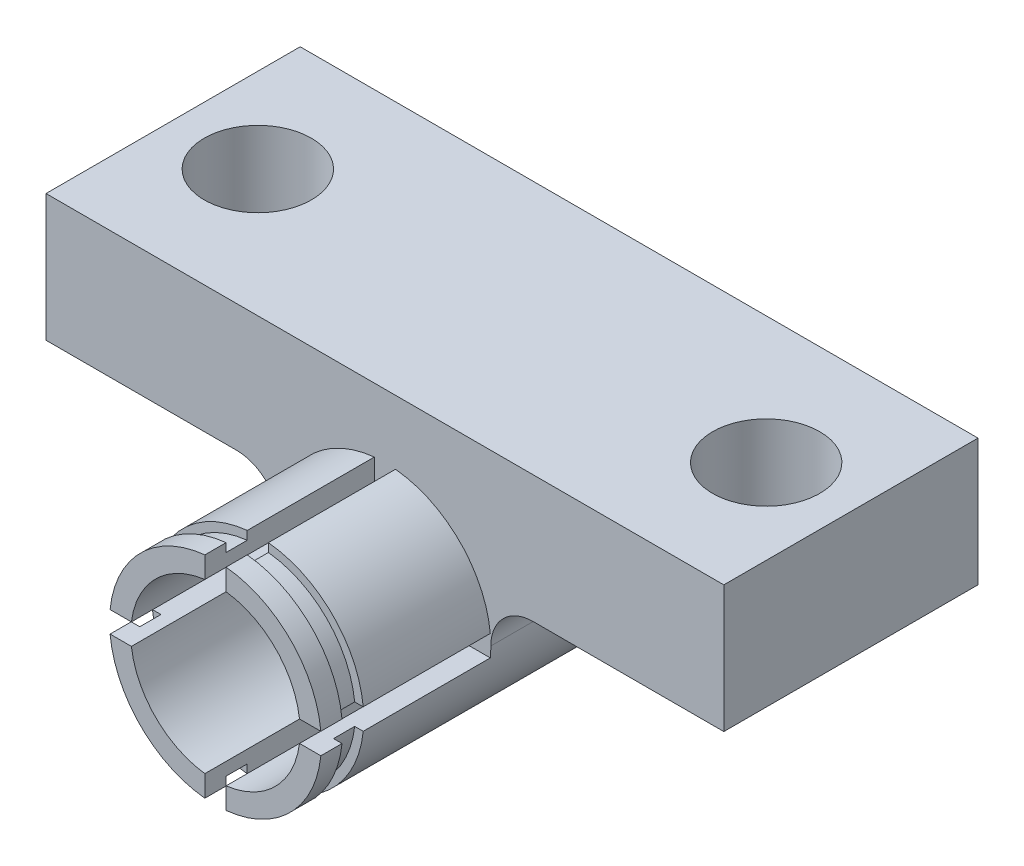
ISO-10303-21;
HEADER;
FILE_DESCRIPTION(('STEP AP214'),'2;1');
FILE_NAME('part.step','',(''),(''),'','','');
FILE_SCHEMA(('AUTOMOTIVE_DESIGN { 1 0 10303 214 1 1 1 1 }'));
ENDSEC;
DATA;
#1=APPLICATION_CONTEXT('core data for automotive mechanical design processes');
#2=APPLICATION_PROTOCOL_DEFINITION('international standard','automotive_design',2000,#1);
#3=PRODUCT_CONTEXT('',#1,'mechanical');
#4=PRODUCT('Part','Part','',(#3));
#5=PRODUCT_RELATED_PRODUCT_CATEGORY('part','',(#4));
#6=PRODUCT_DEFINITION_FORMATION('','',#4);
#7=PRODUCT_DEFINITION_CONTEXT('part definition',#1,'design');
#8=PRODUCT_DEFINITION('design','',#6,#7);
#9=PRODUCT_DEFINITION_SHAPE('','',#8);
#10=(LENGTH_UNIT() NAMED_UNIT(*) SI_UNIT(.MILLI.,.METRE.));
#11=(NAMED_UNIT(*) PLANE_ANGLE_UNIT() SI_UNIT($,.RADIAN.));
#12=(NAMED_UNIT(*) SI_UNIT($,.STERADIAN.) SOLID_ANGLE_UNIT());
#13=UNCERTAINTY_MEASURE_WITH_UNIT(LENGTH_MEASURE(1.E-05),#10,'distance_accuracy_value','');
#14=(GEOMETRIC_REPRESENTATION_CONTEXT(3) GLOBAL_UNCERTAINTY_ASSIGNED_CONTEXT((#13)) GLOBAL_UNIT_ASSIGNED_CONTEXT((#10,
#11,#12)) REPRESENTATION_CONTEXT('',''));
#15=CARTESIAN_POINT('',(0.,0.,0.));
#16=DIRECTION('',(0.,0.,1.));
#17=DIRECTION('',(1.,0.,0.));
#18=AXIS2_PLACEMENT_3D('',#15,#16,#17);
#19=CARTESIAN_POINT('',(25.4,12.7,-31.75));
#20=DIRECTION('',(0.,0.,1.));
#21=DIRECTION('',(1.,0.,0.));
#22=AXIS2_PLACEMENT_3D('',#19,#20,#21);
#23=CYLINDRICAL_SURFACE('',#22,7.93750000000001);
#24=DIRECTION('',(0.,0.,1.));
#25=VECTOR('',#24,1.);
#26=CARTESIAN_POINT('',(17.5022872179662,13.49375,-31.75));
#27=LINE('',#26,#25);
#28=CARTESIAN_POINT('',(17.5022872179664,13.49375,-3.17499999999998));
#29=VERTEX_POINT('',#28);
#30=CARTESIAN_POINT('',(17.5022872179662,13.49375,-12.7));
#31=VERTEX_POINT('',#30);
#32=EDGE_CURVE('E367',#29,#31,#27,.F.);
#33=ORIENTED_EDGE('',*,*,#32,.F.);
#34=CARTESIAN_POINT('',(25.4000000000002,12.7,-3.17499999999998));
#35=DIRECTION('',(0.,0.,1.));
#36=DIRECTION('',(1.,0.,0.));
#37=AXIS2_PLACEMENT_3D('',#34,#35,#36);
#38=CIRCLE('',#37,7.93750000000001);
#39=CARTESIAN_POINT('',(24.6062500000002,20.5977127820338,-3.17499999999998));
#40=VERTEX_POINT('',#39);
#41=EDGE_CURVE('E583',#40,#29,#38,.T.);
#42=ORIENTED_EDGE('',*,*,#41,.F.);
#43=DIRECTION('',(0.,0.,1.));
#44=VECTOR('',#43,1.);
#45=CARTESIAN_POINT('',(24.60625,20.5977127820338,-31.7499999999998));
#46=LINE('',#45,#44);
#47=CARTESIAN_POINT('',(24.60625,20.5977127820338,-12.7));
#48=VERTEX_POINT('',#47);
#49=EDGE_CURVE('E395',#48,#40,#46,.T.);
#50=ORIENTED_EDGE('',*,*,#49,.F.);
#51=CARTESIAN_POINT('',(25.4,12.7,-12.7));
#52=DIRECTION('',(0.,0.,1.));
#53=DIRECTION('',(1.,0.,0.));
#54=AXIS2_PLACEMENT_3D('',#51,#52,#53);
#55=CIRCLE('',#54,7.93750000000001);
#56=EDGE_CURVE('E414',#48,#31,#55,.T.);
#57=ORIENTED_EDGE('',*,*,#56,.T.);
#58=EDGE_LOOP('',(#33,#42,#50,#57));
#59=FACE_BOUND('',#58,.T.);
#60=ADVANCED_FACE('F40',(#59),#23,.T.);
#61=DIRECTION('',(0.,0.,1.));
#62=VECTOR('',#61,1.);
#63=CARTESIAN_POINT('',(26.19375,20.5977127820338,-31.75));
#64=LINE('',#63,#62);
#65=CARTESIAN_POINT('',(26.1937500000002,20.5977127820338,-3.17499999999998));
#66=VERTEX_POINT('',#65);
#67=CARTESIAN_POINT('',(26.19375,20.5977127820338,-12.7));
#68=VERTEX_POINT('',#67);
#69=EDGE_CURVE('E390',#66,#68,#64,.F.);
#70=ORIENTED_EDGE('',*,*,#69,.F.);
#71=CARTESIAN_POINT('',(33.2977127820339,13.49375,-3.17499999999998));
#72=VERTEX_POINT('',#71);
#73=EDGE_CURVE('E543',#72,#66,#38,.T.);
#74=ORIENTED_EDGE('',*,*,#73,.F.);
#75=DIRECTION('',(0.,0.,1.));
#76=VECTOR('',#75,1.);
#77=CARTESIAN_POINT('',(33.2977127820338,13.49375,-31.75));
#78=LINE('',#77,#76);
#79=CARTESIAN_POINT('',(33.2977127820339,13.49375,-12.7));
#80=VERTEX_POINT('',#79);
#81=EDGE_CURVE('E319',#80,#72,#78,.T.);
#82=ORIENTED_EDGE('',*,*,#81,.F.);
#83=EDGE_CURVE('E421',#80,#68,#55,.T.);
#84=ORIENTED_EDGE('',*,*,#83,.T.);
#85=EDGE_LOOP('',(#70,#74,#82,#84));
#86=FACE_BOUND('',#85,.T.);
#87=ADVANCED_FACE('F704',(#86),#23,.T.);
#88=DIRECTION('',(0.,0.,1.));
#89=VECTOR('',#88,1.);
#90=CARTESIAN_POINT('',(33.2977127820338,11.90625,-31.75));
#91=LINE('',#90,#89);
#92=CARTESIAN_POINT('',(33.2977127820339,11.90625,-3.17499999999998));
#93=VERTEX_POINT('',#92);
#94=CARTESIAN_POINT('',(33.2977127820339,11.90625,-12.7));
#95=VERTEX_POINT('',#94);
#96=EDGE_CURVE('E384',#93,#95,#91,.F.);
#97=ORIENTED_EDGE('',*,*,#96,.F.);
#98=CARTESIAN_POINT('',(26.1937500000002,4.8022872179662,-3.17499999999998));
#99=VERTEX_POINT('',#98);
#100=EDGE_CURVE('E542',#99,#93,#38,.T.);
#101=ORIENTED_EDGE('',*,*,#100,.F.);
#102=DIRECTION('',(0.,0.,1.));
#103=VECTOR('',#102,1.);
#104=CARTESIAN_POINT('',(26.19375,4.8022872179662,-31.75));
#105=LINE('',#104,#103);
#106=CARTESIAN_POINT('',(26.19375,4.8022872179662,-12.7));
#107=VERTEX_POINT('',#106);
#108=EDGE_CURVE('E381',#107,#99,#105,.T.);
#109=ORIENTED_EDGE('',*,*,#108,.F.);
#110=CARTESIAN_POINT('',(25.4,12.7,-12.7));
#111=DIRECTION('',(0.,0.,1.));
#112=DIRECTION('',(1.,0.,0.));
#113=AXIS2_PLACEMENT_3D('',#110,#111,#112);
#114=CIRCLE('',#113,7.93750000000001);
#115=CARTESIAN_POINT('',(24.60625,4.8022872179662,-12.7));
#116=VERTEX_POINT('',#115);
#117=EDGE_CURVE('E364',#107,#116,#114,.F.);
#118=ORIENTED_EDGE('',*,*,#117,.T.);
#119=DIRECTION('',(0.,0.,1.));
#120=VECTOR('',#119,1.);
#121=CARTESIAN_POINT('',(24.60625,4.8022872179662,-31.7499999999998));
#122=LINE('',#121,#120);
#123=CARTESIAN_POINT('',(24.6062500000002,4.8022872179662,-3.17499999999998));
#124=VERTEX_POINT('',#123);
#125=EDGE_CURVE('E376',#124,#116,#122,.F.);
#126=ORIENTED_EDGE('',*,*,#125,.F.);
#127=CARTESIAN_POINT('',(17.5022872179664,11.90625,-3.17499999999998));
#128=VERTEX_POINT('',#127);
#129=EDGE_CURVE('E591',#128,#124,#38,.T.);
#130=ORIENTED_EDGE('',*,*,#129,.F.);
#131=DIRECTION('',(0.,0.,1.));
#132=VECTOR('',#131,1.);
#133=CARTESIAN_POINT('',(17.5022872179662,11.90625,-31.75));
#134=LINE('',#133,#132);
#135=CARTESIAN_POINT('',(17.5022872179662,11.90625,-12.7));
#136=VERTEX_POINT('',#135);
#137=EDGE_CURVE('E373',#136,#128,#134,.T.);
#138=ORIENTED_EDGE('',*,*,#137,.F.);
#139=CARTESIAN_POINT('',(17.4625,12.7,-12.7));
#140=VERTEX_POINT('',#139);
#141=EDGE_CURVE('E368',#136,#140,#114,.F.);
#142=ORIENTED_EDGE('',*,*,#141,.T.);
#143=DIRECTION('',(0.,0.,1.));
#144=VECTOR('',#143,1.);
#145=CARTESIAN_POINT('',(17.4625,12.7,-31.75));
#146=LINE('',#145,#144);
#147=CARTESIAN_POINT('',(17.4625,12.7,-31.75));
#148=VERTEX_POINT('',#147);
#149=EDGE_CURVE('E450',#148,#140,#146,.T.);
#150=ORIENTED_EDGE('',*,*,#149,.F.);
#151=CARTESIAN_POINT('',(25.4,12.7,-31.75));
#152=DIRECTION('',(0.,0.,1.));
#153=DIRECTION('',(1.,0.,0.));
#154=AXIS2_PLACEMENT_3D('',#151,#152,#153);
#155=CIRCLE('',#154,7.93750000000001);
#156=CARTESIAN_POINT('',(33.3375,12.7,-31.75));
#157=VERTEX_POINT('',#156);
#158=EDGE_CURVE('E437',#148,#157,#155,.T.);
#159=ORIENTED_EDGE('',*,*,#158,.T.);
#160=DIRECTION('',(0.,0.,1.));
#161=VECTOR('',#160,1.);
#162=CARTESIAN_POINT('',(33.3375,12.7,-31.75));
#163=LINE('',#162,#161);
#164=CARTESIAN_POINT('',(33.3375000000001,12.7,-12.7));
#165=VERTEX_POINT('',#164);
#166=EDGE_CURVE('E446',#157,#165,#163,.T.);
#167=ORIENTED_EDGE('',*,*,#166,.T.);
#168=EDGE_CURVE('E349',#165,#95,#114,.F.);
#169=ORIENTED_EDGE('',*,*,#168,.T.);
#170=EDGE_LOOP('',(#97,#101,#109,#118,#126,#130,#138,#142,#150,#159,#167,#169));
#171=FACE_BOUND('',#170,.T.);
#172=ADVANCED_FACE('F655',(#171),#23,.T.);
#173=CARTESIAN_POINT('',(25.4,12.7,-1.58749999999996));
#174=DIRECTION('',(0.,0.,1.));
#175=DIRECTION('',(1.,0.,0.));
#176=AXIS2_PLACEMENT_3D('',#173,#174,#175);
#177=CIRCLE('',#176,7.93750000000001);
#178=CARTESIAN_POINT('',(26.19375,4.8022872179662,-1.58749999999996));
#179=VERTEX_POINT('',#178);
#180=CARTESIAN_POINT('',(33.2977127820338,11.90625,-1.58750000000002));
#181=VERTEX_POINT('',#180);
#182=EDGE_CURVE('E313',#179,#181,#177,.T.);
#183=ORIENTED_EDGE('',*,*,#182,.T.);
#184=CARTESIAN_POINT('',(33.2977127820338,11.90625,0.));
#185=VERTEX_POINT('',#184);
#186=EDGE_CURVE('E385',#185,#181,#91,.F.);
#187=ORIENTED_EDGE('',*,*,#186,.F.);
#188=CARTESIAN_POINT('',(25.4,12.7,0.));
#189=DIRECTION('',(0.,0.,1.));
#190=DIRECTION('',(1.,0.,0.));
#191=AXIS2_PLACEMENT_3D('',#188,#189,#190);
#192=CIRCLE('',#191,7.93750000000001);
#193=CARTESIAN_POINT('',(26.19375,4.8022872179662,0.));
#194=VERTEX_POINT('',#193);
#195=EDGE_CURVE('E436',#194,#185,#192,.T.);
#196=ORIENTED_EDGE('',*,*,#195,.F.);
#197=EDGE_CURVE('E380',#179,#194,#105,.T.);
#198=ORIENTED_EDGE('',*,*,#197,.F.);
#199=EDGE_LOOP('',(#183,#187,#196,#198));
#200=FACE_BOUND('',#199,.T.);
#201=ADVANCED_FACE('F629',(#200),#23,.T.);
#202=CARTESIAN_POINT('',(26.19375,11.90625,-12.7));
#203=DIRECTION('',(0.,-1.,0.));
#204=DIRECTION('',(0.,0.,-1.));
#205=AXIS2_PLACEMENT_3D('',#202,#203,#204);
#206=PLANE('',#205);
#207=DIRECTION('',(-1.,0.,0.));
#208=VECTOR('',#207,1.);
#209=CARTESIAN_POINT('',(26.1937500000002,11.90625,-3.17499999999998));
#210=LINE('',#209,#208);
#211=CARTESIAN_POINT('',(32.6592332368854,11.90625,-3.17499999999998));
#212=VERTEX_POINT('',#211);
#213=EDGE_CURVE('E320',#93,#212,#210,.T.);
#214=ORIENTED_EDGE('',*,*,#213,.F.);
#215=ORIENTED_EDGE('',*,*,#96,.T.);
#216=DIRECTION('',(1.,0.,0.));
#217=VECTOR('',#216,1.);
#218=CARTESIAN_POINT('',(26.19375,11.90625,-12.7));
#219=LINE('',#218,#217);
#220=CARTESIAN_POINT('',(31.7001953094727,11.90625,-12.7));
#221=VERTEX_POINT('',#220);
#222=EDGE_CURVE('E341',#221,#95,#219,.T.);
#223=ORIENTED_EDGE('',*,*,#222,.F.);
#224=DIRECTION('',(0.,0.,1.));
#225=VECTOR('',#224,1.);
#226=CARTESIAN_POINT('',(31.7001953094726,11.90625,-31.75));
#227=LINE('',#226,#225);
#228=CARTESIAN_POINT('',(31.7001953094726,11.90625,0.));
#229=VERTEX_POINT('',#228);
#230=EDGE_CURVE('E487',#229,#221,#227,.F.);
#231=ORIENTED_EDGE('',*,*,#230,.F.);
#232=DIRECTION('',(1.,0.,0.));
#233=VECTOR('',#232,1.);
#234=CARTESIAN_POINT('',(26.19375,11.90625,0.));
#235=LINE('',#234,#233);
#236=EDGE_CURVE('E359',#229,#185,#235,.T.);
#237=ORIENTED_EDGE('',*,*,#236,.T.);
#238=ORIENTED_EDGE('',*,*,#186,.T.);
#239=DIRECTION('',(-1.,0.,0.));
#240=VECTOR('',#239,1.);
#241=CARTESIAN_POINT('',(26.19375,11.90625,-1.58749999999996));
#242=LINE('',#241,#240);
#243=CARTESIAN_POINT('',(32.6592332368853,11.90625,-1.58750000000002));
#244=VERTEX_POINT('',#243);
#245=EDGE_CURVE('E571',#181,#244,#242,.T.);
#246=ORIENTED_EDGE('',*,*,#245,.T.);
#247=DIRECTION('',(0.,0.,1.));
#248=VECTOR('',#247,1.);
#249=CARTESIAN_POINT('',(32.6592332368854,11.90625,-3.17499999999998));
#250=LINE('',#249,#248);
#251=EDGE_CURVE('E303',#212,#244,#250,.T.);
#252=ORIENTED_EDGE('',*,*,#251,.F.);
#253=EDGE_LOOP('',(#214,#215,#223,#231,#237,#238,#246,#252));
#254=FACE_BOUND('',#253,.T.);
#255=ADVANCED_FACE('F626',(#254),#206,.F.);
#256=CARTESIAN_POINT('',(26.19375,13.49375,-12.7));
#257=DIRECTION('',(0.,1.,0.));
#258=DIRECTION('',(-1.,0.,0.));
#259=AXIS2_PLACEMENT_3D('',#256,#257,#258);
#260=PLANE('',#259);
#261=DIRECTION('',(1.,0.,0.));
#262=VECTOR('',#261,1.);
#263=CARTESIAN_POINT('',(26.1937500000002,13.49375,-3.17499999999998));
#264=LINE('',#263,#262);
#265=CARTESIAN_POINT('',(32.6592332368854,13.49375,-3.17499999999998));
#266=VERTEX_POINT('',#265);
#267=EDGE_CURVE('E308',#266,#72,#264,.T.);
#268=ORIENTED_EDGE('',*,*,#267,.F.);
#269=DIRECTION('',(0.,0.,1.));
#270=VECTOR('',#269,1.);
#271=CARTESIAN_POINT('',(32.6592332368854,13.49375,-3.17499999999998));
#272=LINE('',#271,#270);
#273=CARTESIAN_POINT('',(32.6592332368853,13.49375,-1.58750000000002));
#274=VERTEX_POINT('',#273);
#275=EDGE_CURVE('E296',#274,#266,#272,.F.);
#276=ORIENTED_EDGE('',*,*,#275,.F.);
#277=DIRECTION('',(1.,0.,0.));
#278=VECTOR('',#277,1.);
#279=CARTESIAN_POINT('',(26.19375,13.49375,-1.58749999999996));
#280=LINE('',#279,#278);
#281=CARTESIAN_POINT('',(33.2977127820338,13.49375,-1.58750000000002));
#282=VERTEX_POINT('',#281);
#283=EDGE_CURVE('E569',#274,#282,#280,.T.);
#284=ORIENTED_EDGE('',*,*,#283,.T.);
#285=CARTESIAN_POINT('',(33.2977127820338,13.49375,0.));
#286=VERTEX_POINT('',#285);
#287=EDGE_CURVE('E388',#282,#286,#78,.T.);
#288=ORIENTED_EDGE('',*,*,#287,.T.);
#289=DIRECTION('',(-1.,0.,0.));
#290=VECTOR('',#289,1.);
#291=CARTESIAN_POINT('',(26.19375,13.49375,0.));
#292=LINE('',#291,#290);
#293=CARTESIAN_POINT('',(31.7001953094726,13.49375,0.));
#294=VERTEX_POINT('',#293);
#295=EDGE_CURVE('E361',#286,#294,#292,.T.);
#296=ORIENTED_EDGE('',*,*,#295,.T.);
#297=DIRECTION('',(0.,0.,1.));
#298=VECTOR('',#297,1.);
#299=CARTESIAN_POINT('',(31.7001953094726,13.49375,-31.75));
#300=LINE('',#299,#298);
#301=CARTESIAN_POINT('',(31.7001953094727,13.49375,-12.7));
#302=VERTEX_POINT('',#301);
#303=EDGE_CURVE('E492',#302,#294,#300,.T.);
#304=ORIENTED_EDGE('',*,*,#303,.F.);
#305=DIRECTION('',(-1.,0.,0.));
#306=VECTOR('',#305,1.);
#307=CARTESIAN_POINT('',(26.19375,13.49375,-12.7));
#308=LINE('',#307,#306);
#309=EDGE_CURVE('E344',#80,#302,#308,.T.);
#310=ORIENTED_EDGE('',*,*,#309,.F.);
#311=ORIENTED_EDGE('',*,*,#81,.T.);
#312=EDGE_LOOP('',(#268,#276,#284,#288,#296,#304,#310,#311));
#313=FACE_BOUND('',#312,.T.);
#314=ADVANCED_FACE('F317',(#313),#260,.F.);
#315=CARTESIAN_POINT('',(26.19375,32.5435689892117,-12.7));
#316=DIRECTION('',(1.,0.,0.));
#317=DIRECTION('',(0.,1.,0.));
#318=AXIS2_PLACEMENT_3D('',#315,#316,#317);
#319=PLANE('',#318);
#320=DIRECTION('',(0.,-1.,0.));
#321=VECTOR('',#320,1.);
#322=CARTESIAN_POINT('',(26.1937500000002,32.5435689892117,-3.17499999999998));
#323=LINE('',#322,#321);
#324=CARTESIAN_POINT('',(26.1937500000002,19.9592332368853,-3.17499999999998));
#325=VERTEX_POINT('',#324);
#326=EDGE_CURVE('E311',#66,#325,#323,.T.);
#327=ORIENTED_EDGE('',*,*,#326,.F.);
#328=ORIENTED_EDGE('',*,*,#69,.T.);
#329=DIRECTION('',(0.,1.,0.));
#330=VECTOR('',#329,1.);
#331=CARTESIAN_POINT('',(26.19375,32.5435689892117,-12.7));
#332=LINE('',#331,#330);
#333=CARTESIAN_POINT('',(26.19375,19.0001953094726,-12.7));
#334=VERTEX_POINT('',#333);
#335=EDGE_CURVE('E346',#334,#68,#332,.T.);
#336=ORIENTED_EDGE('',*,*,#335,.F.);
#337=DIRECTION('',(0.,0.,1.));
#338=VECTOR('',#337,1.);
#339=CARTESIAN_POINT('',(26.19375,19.0001953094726,-31.75));
#340=LINE('',#339,#338);
#341=CARTESIAN_POINT('',(26.19375,19.0001953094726,0.));
#342=VERTEX_POINT('',#341);
#343=EDGE_CURVE('E495',#342,#334,#340,.F.);
#344=ORIENTED_EDGE('',*,*,#343,.F.);
#345=DIRECTION('',(0.,1.,0.));
#346=VECTOR('',#345,1.);
#347=CARTESIAN_POINT('',(26.19375,32.5435689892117,0.));
#348=LINE('',#347,#346);
#349=CARTESIAN_POINT('',(26.19375,20.5977127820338,0.));
#350=VERTEX_POINT('',#349);
#351=EDGE_CURVE('E331',#342,#350,#348,.T.);
#352=ORIENTED_EDGE('',*,*,#351,.T.);
#353=CARTESIAN_POINT('',(26.19375,20.5977127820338,-1.58749999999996));
#354=VERTEX_POINT('',#353);
#355=EDGE_CURVE('E391',#350,#354,#64,.F.);
#356=ORIENTED_EDGE('',*,*,#355,.T.);
#357=DIRECTION('',(0.,-1.,0.));
#358=VECTOR('',#357,1.);
#359=CARTESIAN_POINT('',(26.19375,32.5435689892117,-1.58749999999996));
#360=LINE('',#359,#358);
#361=CARTESIAN_POINT('',(26.19375,19.9592332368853,-1.58749999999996));
#362=VERTEX_POINT('',#361);
#363=EDGE_CURVE('E566',#354,#362,#360,.T.);
#364=ORIENTED_EDGE('',*,*,#363,.T.);
#365=DIRECTION('',(0.,0.,1.));
#366=VECTOR('',#365,1.);
#367=CARTESIAN_POINT('',(26.1937500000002,19.9592332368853,-3.17499999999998));
#368=LINE('',#367,#366);
#369=EDGE_CURVE('E304',#325,#362,#368,.T.);
#370=ORIENTED_EDGE('',*,*,#369,.F.);
#371=EDGE_LOOP('',(#327,#328,#336,#344,#352,#356,#364,#370));
#372=FACE_BOUND('',#371,.T.);
#373=ADVANCED_FACE('F733',(#372),#319,.F.);
#374=CARTESIAN_POINT('',(24.60625,32.5435689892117,-12.7));
#375=DIRECTION('',(-1.,0.,0.));
#376=DIRECTION('',(0.,-1.,0.));
#377=AXIS2_PLACEMENT_3D('',#374,#375,#376);
#378=PLANE('',#377);
#379=DIRECTION('',(0.,1.,0.));
#380=VECTOR('',#379,1.);
#381=CARTESIAN_POINT('',(24.6062500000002,32.5435689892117,-3.17499999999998));
#382=LINE('',#381,#380);
#383=CARTESIAN_POINT('',(24.6062500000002,19.9592332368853,-3.17499999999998));
#384=VERTEX_POINT('',#383);
#385=EDGE_CURVE('E324',#384,#40,#382,.T.);
#386=ORIENTED_EDGE('',*,*,#385,.F.);
#387=DIRECTION('',(0.,0.,1.));
#388=VECTOR('',#387,1.);
#389=CARTESIAN_POINT('',(24.6062500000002,19.9592332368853,-3.17499999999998));
#390=LINE('',#389,#388);
#391=CARTESIAN_POINT('',(24.60625,19.9592332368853,-1.58749999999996));
#392=VERTEX_POINT('',#391);
#393=EDGE_CURVE('E551',#392,#384,#390,.F.);
#394=ORIENTED_EDGE('',*,*,#393,.F.);
#395=DIRECTION('',(0.,1.,0.));
#396=VECTOR('',#395,1.);
#397=CARTESIAN_POINT('',(24.60625,32.5435689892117,-1.58749999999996));
#398=LINE('',#397,#396);
#399=CARTESIAN_POINT('',(24.60625,20.5977127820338,-1.58749999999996));
#400=VERTEX_POINT('',#399);
#401=EDGE_CURVE('E563',#392,#400,#398,.T.);
#402=ORIENTED_EDGE('',*,*,#401,.T.);
#403=CARTESIAN_POINT('',(24.60625,20.5977127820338,0.));
#404=VERTEX_POINT('',#403);
#405=EDGE_CURVE('E394',#400,#404,#46,.T.);
#406=ORIENTED_EDGE('',*,*,#405,.T.);
#407=DIRECTION('',(0.,-1.,0.));
#408=VECTOR('',#407,1.);
#409=CARTESIAN_POINT('',(24.60625,32.5435689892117,0.));
#410=LINE('',#409,#408);
#411=CARTESIAN_POINT('',(24.60625,19.0001953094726,0.));
#412=VERTEX_POINT('',#411);
#413=EDGE_CURVE('E322',#404,#412,#410,.T.);
#414=ORIENTED_EDGE('',*,*,#413,.T.);
#415=DIRECTION('',(0.,0.,1.));
#416=VECTOR('',#415,1.);
#417=CARTESIAN_POINT('',(24.60625,19.0001953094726,-31.7499999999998));
#418=LINE('',#417,#416);
#419=CARTESIAN_POINT('',(24.60625,19.0001953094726,-12.7));
#420=VERTEX_POINT('',#419);
#421=EDGE_CURVE('E498',#420,#412,#418,.T.);
#422=ORIENTED_EDGE('',*,*,#421,.F.);
#423=DIRECTION('',(0.,-1.,0.));
#424=VECTOR('',#423,1.);
#425=CARTESIAN_POINT('',(24.60625,32.5435689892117,-12.7));
#426=LINE('',#425,#424);
#427=EDGE_CURVE('E328',#48,#420,#426,.T.);
#428=ORIENTED_EDGE('',*,*,#427,.F.);
#429=ORIENTED_EDGE('',*,*,#49,.T.);
#430=EDGE_LOOP('',(#386,#394,#402,#406,#414,#422,#428,#429));
#431=FACE_BOUND('',#430,.T.);
#432=ADVANCED_FACE('F592',(#431),#378,.F.);
#433=CARTESIAN_POINT('',(6.08699207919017,13.49375,-12.6999999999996));
#434=DIRECTION('',(0.,1.,0.));
#435=DIRECTION('',(-1.,0.,0.));
#436=AXIS2_PLACEMENT_3D('',#433,#434,#435);
#437=PLANE('',#436);
#438=DIRECTION('',(1.,0.,0.));
#439=VECTOR('',#438,1.);
#440=CARTESIAN_POINT('',(6.08699207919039,13.49375,-3.17499999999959));
#441=LINE('',#440,#439);
#442=CARTESIAN_POINT('',(18.1407667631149,13.49375,-3.17499999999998));
#443=VERTEX_POINT('',#442);
#444=EDGE_CURVE('E578',#29,#443,#441,.T.);
#445=ORIENTED_EDGE('',*,*,#444,.F.);
#446=ORIENTED_EDGE('',*,*,#32,.T.);
#447=DIRECTION('',(-1.,0.,0.));
#448=VECTOR('',#447,1.);
#449=CARTESIAN_POINT('',(6.08699207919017,13.49375,-12.6999999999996));
#450=LINE('',#449,#448);
#451=CARTESIAN_POINT('',(19.0998046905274,13.49375,-12.7));
#452=VERTEX_POINT('',#451);
#453=EDGE_CURVE('E330',#452,#31,#450,.T.);
#454=ORIENTED_EDGE('',*,*,#453,.F.);
#455=DIRECTION('',(0.,0.,1.));
#456=VECTOR('',#455,1.);
#457=CARTESIAN_POINT('',(19.0998046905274,13.49375,-31.75));
#458=LINE('',#457,#456);
#459=CARTESIAN_POINT('',(19.0998046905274,13.49375,0.));
#460=VERTEX_POINT('',#459);
#461=EDGE_CURVE('E502',#460,#452,#458,.F.);
#462=ORIENTED_EDGE('',*,*,#461,.F.);
#463=DIRECTION('',(-1.,0.,0.));
#464=VECTOR('',#463,1.);
#465=CARTESIAN_POINT('',(6.08699207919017,13.49375,4.44089209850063E-13));
#466=LINE('',#465,#464);
#467=CARTESIAN_POINT('',(17.5022872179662,13.49375,0.));
#468=VERTEX_POINT('',#467);
#469=EDGE_CURVE('E351',#460,#468,#466,.T.);
#470=ORIENTED_EDGE('',*,*,#469,.T.);
#471=CARTESIAN_POINT('',(17.5022872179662,13.49375,-1.58750000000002));
#472=VERTEX_POINT('',#471);
#473=EDGE_CURVE('E369',#468,#472,#27,.F.);
#474=ORIENTED_EDGE('',*,*,#473,.T.);
#475=DIRECTION('',(1.,0.,0.));
#476=VECTOR('',#475,1.);
#477=CARTESIAN_POINT('',(6.08699207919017,13.49375,-1.58749999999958));
#478=LINE('',#477,#476);
#479=CARTESIAN_POINT('',(18.1407667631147,13.49375,-1.58750000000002));
#480=VERTEX_POINT('',#479);
#481=EDGE_CURVE('E560',#472,#480,#478,.T.);
#482=ORIENTED_EDGE('',*,*,#481,.T.);
#483=DIRECTION('',(0.,0.,1.));
#484=VECTOR('',#483,1.);
#485=CARTESIAN_POINT('',(18.1407667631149,13.49375,-3.17499999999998));
#486=LINE('',#485,#484);
#487=EDGE_CURVE('E549',#443,#480,#486,.T.);
#488=ORIENTED_EDGE('',*,*,#487,.F.);
#489=EDGE_LOOP('',(#445,#446,#454,#462,#470,#474,#482,#488));
#490=FACE_BOUND('',#489,.T.);
#491=ADVANCED_FACE('F601',(#490),#437,.F.);
#492=CARTESIAN_POINT('',(6.08699207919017,11.90625,-12.6999999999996));
#493=DIRECTION('',(0.,-1.,0.));
#494=DIRECTION('',(0.,0.,-1.));
#495=AXIS2_PLACEMENT_3D('',#492,#493,#494);
#496=PLANE('',#495);
#497=DIRECTION('',(-1.,0.,0.));
#498=VECTOR('',#497,1.);
#499=CARTESIAN_POINT('',(6.08699207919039,11.90625,-3.17499999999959));
#500=LINE('',#499,#498);
#501=CARTESIAN_POINT('',(18.1407667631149,11.90625,-3.17499999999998));
#502=VERTEX_POINT('',#501);
#503=EDGE_CURVE('E576',#502,#128,#500,.T.);
#504=ORIENTED_EDGE('',*,*,#503,.F.);
#505=DIRECTION('',(0.,0.,1.));
#506=VECTOR('',#505,1.);
#507=CARTESIAN_POINT('',(18.1407667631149,11.90625,-3.17499999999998));
#508=LINE('',#507,#506);
#509=CARTESIAN_POINT('',(18.1407667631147,11.90625,-1.58750000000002));
#510=VERTEX_POINT('',#509);
#511=EDGE_CURVE('E547',#510,#502,#508,.F.);
#512=ORIENTED_EDGE('',*,*,#511,.F.);
#513=DIRECTION('',(-1.,0.,0.));
#514=VECTOR('',#513,1.);
#515=CARTESIAN_POINT('',(6.08699207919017,11.90625,-1.58749999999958));
#516=LINE('',#515,#514);
#517=CARTESIAN_POINT('',(17.5022872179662,11.90625,-1.58750000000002));
#518=VERTEX_POINT('',#517);
#519=EDGE_CURVE('E558',#510,#518,#516,.T.);
#520=ORIENTED_EDGE('',*,*,#519,.T.);
#521=CARTESIAN_POINT('',(17.5022872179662,11.90625,0.));
#522=VERTEX_POINT('',#521);
#523=EDGE_CURVE('E372',#518,#522,#134,.T.);
#524=ORIENTED_EDGE('',*,*,#523,.T.);
#525=DIRECTION('',(1.,0.,0.));
#526=VECTOR('',#525,1.);
#527=CARTESIAN_POINT('',(6.08699207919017,11.90625,4.44089209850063E-13));
#528=LINE('',#527,#526);
#529=CARTESIAN_POINT('',(19.0998046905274,11.90625,0.));
#530=VERTEX_POINT('',#529);
#531=EDGE_CURVE('E353',#522,#530,#528,.T.);
#532=ORIENTED_EDGE('',*,*,#531,.T.);
#533=DIRECTION('',(0.,0.,1.));
#534=VECTOR('',#533,1.);
#535=CARTESIAN_POINT('',(19.0998046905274,11.90625,-31.75));
#536=LINE('',#535,#534);
#537=CARTESIAN_POINT('',(19.0998046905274,11.90625,-12.7));
#538=VERTEX_POINT('',#537);
#539=EDGE_CURVE('E505',#538,#530,#536,.T.);
#540=ORIENTED_EDGE('',*,*,#539,.F.);
#541=DIRECTION('',(1.,0.,0.));
#542=VECTOR('',#541,1.);
#543=CARTESIAN_POINT('',(6.08699207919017,11.90625,-12.6999999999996));
#544=LINE('',#543,#542);
#545=EDGE_CURVE('E334',#136,#538,#544,.T.);
#546=ORIENTED_EDGE('',*,*,#545,.F.);
#547=ORIENTED_EDGE('',*,*,#137,.T.);
#548=EDGE_LOOP('',(#504,#512,#520,#524,#532,#540,#546,#547));
#549=FACE_BOUND('',#548,.T.);
#550=ADVANCED_FACE('F789',(#549),#496,.F.);
#551=CARTESIAN_POINT('',(26.19375,11.90625,-12.7));
#552=DIRECTION('',(1.,0.,0.));
#553=DIRECTION('',(0.,1.,0.));
#554=AXIS2_PLACEMENT_3D('',#551,#552,#553);
#555=PLANE('',#554);
#556=DIRECTION('',(0.,-1.,0.));
#557=VECTOR('',#556,1.);
#558=CARTESIAN_POINT('',(26.1937500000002,11.90625,-3.17499999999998));
#559=LINE('',#558,#557);
#560=CARTESIAN_POINT('',(26.1937500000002,5.4407667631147,-3.17499999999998));
#561=VERTEX_POINT('',#560);
#562=EDGE_CURVE('E574',#561,#99,#559,.T.);
#563=ORIENTED_EDGE('',*,*,#562,.F.);
#564=DIRECTION('',(0.,0.,1.));
#565=VECTOR('',#564,1.);
#566=CARTESIAN_POINT('',(26.1937500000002,5.4407667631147,-3.17499999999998));
#567=LINE('',#566,#565);
#568=CARTESIAN_POINT('',(26.19375,5.4407667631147,-1.58749999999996));
#569=VERTEX_POINT('',#568);
#570=EDGE_CURVE('E545',#569,#561,#567,.F.);
#571=ORIENTED_EDGE('',*,*,#570,.F.);
#572=DIRECTION('',(0.,-1.,0.));
#573=VECTOR('',#572,1.);
#574=CARTESIAN_POINT('',(26.19375,11.90625,-1.58749999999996));
#575=LINE('',#574,#573);
#576=EDGE_CURVE('E555',#569,#179,#575,.T.);
#577=ORIENTED_EDGE('',*,*,#576,.T.);
#578=ORIENTED_EDGE('',*,*,#197,.T.);
#579=DIRECTION('',(0.,1.,0.));
#580=VECTOR('',#579,1.);
#581=CARTESIAN_POINT('',(26.19375,11.90625,0.));
#582=LINE('',#581,#580);
#583=CARTESIAN_POINT('',(26.19375,6.39980469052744,0.));
#584=VERTEX_POINT('',#583);
#585=EDGE_CURVE('E357',#194,#584,#582,.T.);
#586=ORIENTED_EDGE('',*,*,#585,.T.);
#587=DIRECTION('',(0.,0.,1.));
#588=VECTOR('',#587,1.);
#589=CARTESIAN_POINT('',(26.19375,6.39980469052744,-31.75));
#590=LINE('',#589,#588);
#591=CARTESIAN_POINT('',(26.19375,6.39980469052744,-12.7));
#592=VERTEX_POINT('',#591);
#593=EDGE_CURVE('E511',#592,#584,#590,.T.);
#594=ORIENTED_EDGE('',*,*,#593,.F.);
#595=DIRECTION('',(0.,1.,0.));
#596=VECTOR('',#595,1.);
#597=CARTESIAN_POINT('',(26.19375,11.90625,-12.7));
#598=LINE('',#597,#596);
#599=EDGE_CURVE('E339',#107,#592,#598,.T.);
#600=ORIENTED_EDGE('',*,*,#599,.F.);
#601=ORIENTED_EDGE('',*,*,#108,.T.);
#602=EDGE_LOOP('',(#563,#571,#577,#578,#586,#594,#600,#601));
#603=FACE_BOUND('',#602,.T.);
#604=ADVANCED_FACE('F638',(#603),#555,.F.);
#605=CARTESIAN_POINT('',(24.60625,11.90625,-12.7));
#606=DIRECTION('',(-1.,0.,0.));
#607=DIRECTION('',(0.,-1.,0.));
#608=AXIS2_PLACEMENT_3D('',#605,#606,#607);
#609=PLANE('',#608);
#610=DIRECTION('',(0.,1.,0.));
#611=VECTOR('',#610,1.);
#612=CARTESIAN_POINT('',(24.6062500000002,11.90625,-3.17499999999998));
#613=LINE('',#612,#611);
#614=CARTESIAN_POINT('',(24.6062500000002,5.4407667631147,-3.17499999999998));
#615=VERTEX_POINT('',#614);
#616=EDGE_CURVE('E12',#124,#615,#613,.T.);
#617=ORIENTED_EDGE('',*,*,#616,.F.);
#618=ORIENTED_EDGE('',*,*,#125,.T.);
#619=DIRECTION('',(0.,-1.,0.));
#620=VECTOR('',#619,1.);
#621=CARTESIAN_POINT('',(24.60625,11.90625,-12.7));
#622=LINE('',#621,#620);
#623=CARTESIAN_POINT('',(24.60625,6.39980469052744,-12.7));
#624=VERTEX_POINT('',#623);
#625=EDGE_CURVE('E336',#624,#116,#622,.T.);
#626=ORIENTED_EDGE('',*,*,#625,.F.);
#627=DIRECTION('',(0.,0.,1.));
#628=VECTOR('',#627,1.);
#629=CARTESIAN_POINT('',(24.60625,6.39980469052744,-31.7499999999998));
#630=LINE('',#629,#628);
#631=CARTESIAN_POINT('',(24.60625,6.39980469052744,0.));
#632=VERTEX_POINT('',#631);
#633=EDGE_CURVE('E508',#632,#624,#630,.F.);
#634=ORIENTED_EDGE('',*,*,#633,.F.);
#635=DIRECTION('',(0.,-1.,0.));
#636=VECTOR('',#635,1.);
#637=CARTESIAN_POINT('',(24.60625,11.90625,0.));
#638=LINE('',#637,#636);
#639=CARTESIAN_POINT('',(24.60625,4.8022872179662,0.));
#640=VERTEX_POINT('',#639);
#641=EDGE_CURVE('E355',#632,#640,#638,.T.);
#642=ORIENTED_EDGE('',*,*,#641,.T.);
#643=CARTESIAN_POINT('',(24.60625,4.8022872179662,-1.58749999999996));
#644=VERTEX_POINT('',#643);
#645=EDGE_CURVE('E377',#640,#644,#122,.F.);
#646=ORIENTED_EDGE('',*,*,#645,.T.);
#647=DIRECTION('',(0.,1.,0.));
#648=VECTOR('',#647,1.);
#649=CARTESIAN_POINT('',(24.60625,11.90625,-1.58749999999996));
#650=LINE('',#649,#648);
#651=CARTESIAN_POINT('',(24.60625,5.4407667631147,-1.58749999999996));
#652=VERTEX_POINT('',#651);
#653=EDGE_CURVE('E48',#644,#652,#650,.T.);
#654=ORIENTED_EDGE('',*,*,#653,.T.);
#655=DIRECTION('',(0.,0.,1.));
#656=VECTOR('',#655,1.);
#657=CARTESIAN_POINT('',(24.6062500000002,5.4407667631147,-3.17499999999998));
#658=LINE('',#657,#656);
#659=EDGE_CURVE('E514',#615,#652,#658,.T.);
#660=ORIENTED_EDGE('',*,*,#659,.F.);
#661=EDGE_LOOP('',(#617,#618,#626,#634,#642,#646,#654,#660));
#662=FACE_BOUND('',#661,.T.);
#663=ADVANCED_FACE('F519',(#662),#609,.F.);
#664=CARTESIAN_POINT('',(0.,25.4,0.));
#665=DIRECTION('',(0.,0.,-1.));
#666=DIRECTION('',(-1.,0.,0.));
#667=AXIS2_PLACEMENT_3D('',#664,#665,#666);
#668=PLANE('',#667);
#669=CARTESIAN_POINT('',(25.4,12.7,0.));
#670=DIRECTION('',(0.,0.,1.));
#671=DIRECTION('',(1.,0.,0.));
#672=AXIS2_PLACEMENT_3D('',#669,#670,#671);
#673=CIRCLE('',#672,6.35);
#674=EDGE_CURVE('E418',#412,#460,#673,.T.);
#675=ORIENTED_EDGE('',*,*,#674,.F.);
#676=ORIENTED_EDGE('',*,*,#413,.F.);
#677=EDGE_CURVE('E449',#404,#468,#192,.T.);
#678=ORIENTED_EDGE('',*,*,#677,.T.);
#679=ORIENTED_EDGE('',*,*,#469,.F.);
#680=EDGE_LOOP('',(#675,#676,#678,#679));
#681=FACE_BOUND('',#680,.T.);
#682=ADVANCED_FACE('F835',(#681),#668,.F.);
#683=EDGE_CURVE('E441',#286,#350,#192,.T.);
#684=ORIENTED_EDGE('',*,*,#683,.T.);
#685=ORIENTED_EDGE('',*,*,#351,.F.);
#686=EDGE_CURVE('E415',#294,#342,#673,.T.);
#687=ORIENTED_EDGE('',*,*,#686,.F.);
#688=ORIENTED_EDGE('',*,*,#295,.F.);
#689=EDGE_LOOP('',(#684,#685,#687,#688));
#690=FACE_BOUND('',#689,.T.);
#691=ADVANCED_FACE('F737',(#690),#668,.F.);
#692=ORIENTED_EDGE('',*,*,#195,.T.);
#693=ORIENTED_EDGE('',*,*,#236,.F.);
#694=EDGE_CURVE('E410',#584,#229,#673,.T.);
#695=ORIENTED_EDGE('',*,*,#694,.F.);
#696=ORIENTED_EDGE('',*,*,#585,.F.);
#697=EDGE_LOOP('',(#692,#693,#695,#696));
#698=FACE_BOUND('',#697,.T.);
#699=ADVANCED_FACE('F621',(#698),#668,.F.);
#700=EDGE_CURVE('E534',#400,#472,#177,.T.);
#701=ORIENTED_EDGE('',*,*,#700,.T.);
#702=ORIENTED_EDGE('',*,*,#473,.F.);
#703=ORIENTED_EDGE('',*,*,#677,.F.);
#704=ORIENTED_EDGE('',*,*,#405,.F.);
#705=EDGE_LOOP('',(#701,#702,#703,#704));
#706=FACE_BOUND('',#705,.T.);
#707=ADVANCED_FACE('F721',(#706),#23,.T.);
#708=EDGE_CURVE('E537',#282,#354,#177,.T.);
#709=ORIENTED_EDGE('',*,*,#708,.T.);
#710=ORIENTED_EDGE('',*,*,#355,.F.);
#711=ORIENTED_EDGE('',*,*,#683,.F.);
#712=ORIENTED_EDGE('',*,*,#287,.F.);
#713=EDGE_LOOP('',(#709,#710,#711,#712));
#714=FACE_BOUND('',#713,.T.);
#715=ADVANCED_FACE('F712',(#714),#23,.T.);
#716=CARTESIAN_POINT('',(0.,25.4,0.));
#717=DIRECTION('',(1.,0.,0.));
#718=DIRECTION('',(0.,0.,-1.));
#719=AXIS2_PLACEMENT_3D('',#716,#717,#718);
#720=PLANE('',#719);
#721=DIRECTION('',(0.,-1.,0.));
#722=VECTOR('',#721,1.);
#723=CARTESIAN_POINT('',(0.,25.4,-12.7));
#724=LINE('',#723,#722);
#725=CARTESIAN_POINT('',(0.,25.4,-12.7));
#726=VERTEX_POINT('',#725);
#727=CARTESIAN_POINT('',(0.,15.875,-12.7));
#728=VERTEX_POINT('',#727);
#729=EDGE_CURVE('E425',#726,#728,#724,.T.);
#730=ORIENTED_EDGE('',*,*,#729,.F.);
#731=DIRECTION('',(0.,0.,1.));
#732=VECTOR('',#731,1.);
#733=CARTESIAN_POINT('',(0.,25.4,0.));
#734=LINE('',#733,#732);
#735=CARTESIAN_POINT('',(0.,25.4,-31.75));
#736=VERTEX_POINT('',#735);
#737=EDGE_CURVE('E453',#736,#726,#734,.T.);
#738=ORIENTED_EDGE('',*,*,#737,.F.);
#739=DIRECTION('',(0.,-1.,0.));
#740=VECTOR('',#739,1.);
#741=CARTESIAN_POINT('',(0.,25.4,-31.75));
#742=LINE('',#741,#740);
#743=CARTESIAN_POINT('',(0.,15.875,-31.75));
#744=VERTEX_POINT('',#743);
#745=EDGE_CURVE('E468',#736,#744,#742,.T.);
#746=ORIENTED_EDGE('',*,*,#745,.T.);
#747=DIRECTION('',(0.,0.,1.));
#748=VECTOR('',#747,1.);
#749=CARTESIAN_POINT('',(0.,15.875,-31.75));
#750=LINE('',#749,#748);
#751=EDGE_CURVE('E454',#744,#728,#750,.T.);
#752=ORIENTED_EDGE('',*,*,#751,.T.);
#753=EDGE_LOOP('',(#730,#738,#746,#752));
#754=FACE_BOUND('',#753,.T.);
#755=ADVANCED_FACE('F676',(#754),#720,.F.);
#756=EDGE_CURVE('E782',#522,#640,#192,.T.);
#757=ORIENTED_EDGE('',*,*,#756,.T.);
#758=ORIENTED_EDGE('',*,*,#641,.F.);
#759=EDGE_CURVE('E610',#530,#632,#673,.T.);
#760=ORIENTED_EDGE('',*,*,#759,.F.);
#761=ORIENTED_EDGE('',*,*,#531,.F.);
#762=EDGE_LOOP('',(#757,#758,#760,#761));
#763=FACE_BOUND('',#762,.T.);
#764=ADVANCED_FACE('F727',(#763),#668,.F.);
#765=CARTESIAN_POINT('',(50.8000000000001,25.4,0.));
#766=DIRECTION('',(-1.,0.,0.));
#767=DIRECTION('',(0.,0.,1.));
#768=AXIS2_PLACEMENT_3D('',#765,#766,#767);
#769=PLANE('',#768);
#770=DIRECTION('',(0.,1.,0.));
#771=VECTOR('',#770,1.);
#772=CARTESIAN_POINT('',(50.7999999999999,25.4,-12.7));
#773=LINE('',#772,#771);
#774=CARTESIAN_POINT('',(50.7999999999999,15.875,-12.7));
#775=VERTEX_POINT('',#774);
#776=CARTESIAN_POINT('',(50.7999999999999,25.4,-12.7));
#777=VERTEX_POINT('',#776);
#778=EDGE_CURVE('E429',#775,#777,#773,.T.);
#779=ORIENTED_EDGE('',*,*,#778,.F.);
#780=DIRECTION('',(0.,0.,1.));
#781=VECTOR('',#780,1.);
#782=CARTESIAN_POINT('',(50.8000000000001,15.875,-31.75));
#783=LINE('',#782,#781);
#784=CARTESIAN_POINT('',(50.8000000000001,15.875,-31.75));
#785=VERTEX_POINT('',#784);
#786=EDGE_CURVE('E457',#785,#775,#783,.T.);
#787=ORIENTED_EDGE('',*,*,#786,.F.);
#788=DIRECTION('',(0.,-1.,0.));
#789=VECTOR('',#788,1.);
#790=CARTESIAN_POINT('',(50.8000000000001,25.4,-31.75));
#791=LINE('',#790,#789);
#792=CARTESIAN_POINT('',(50.8000000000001,25.4,-31.75));
#793=VERTEX_POINT('',#792);
#794=EDGE_CURVE('E471',#793,#785,#791,.T.);
#795=ORIENTED_EDGE('',*,*,#794,.F.);
#796=DIRECTION('',(0.,0.,-1.));
#797=VECTOR('',#796,1.);
#798=CARTESIAN_POINT('',(50.8000000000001,25.4,0.));
#799=LINE('',#798,#797);
#800=EDGE_CURVE('E464',#777,#793,#799,.T.);
#801=ORIENTED_EDGE('',*,*,#800,.F.);
#802=EDGE_LOOP('',(#779,#787,#795,#801));
#803=FACE_BOUND('',#802,.T.);
#804=ADVANCED_FACE('F688',(#803),#769,.F.);
#805=CARTESIAN_POINT('',(0.,25.4,-31.75));
#806=DIRECTION('',(0.,-1.,0.));
#807=DIRECTION('',(0.,0.,-1.));
#808=AXIS2_PLACEMENT_3D('',#805,#806,#807);
#809=PLANE('',#808);
#810=CARTESIAN_POINT('',(6.34999999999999,25.4,-22.2249999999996));
#811=DIRECTION('',(0.,-1.,0.));
#812=DIRECTION('',(0.,0.,-1.));
#813=AXIS2_PLACEMENT_3D('',#810,#811,#812);
#814=CIRCLE('',#813,4.0132);
#815=CARTESIAN_POINT('',(6.34999999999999,25.4,-26.2381999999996));
#816=VERTEX_POINT('',#815);
#817=EDGE_CURVE('E401',#816,#816,#814,.T.);
#818=ORIENTED_EDGE('',*,*,#817,.T.);
#819=EDGE_LOOP('',(#818));
#820=FACE_BOUND('',#819,.T.);
#821=CARTESIAN_POINT('',(44.4500000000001,25.4,-22.225));
#822=DIRECTION('',(0.,-1.,0.));
#823=DIRECTION('',(0.,0.,-1.));
#824=AXIS2_PLACEMENT_3D('',#821,#822,#823);
#825=CIRCLE('',#824,4.01319999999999);
#826=CARTESIAN_POINT('',(44.4500000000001,25.4,-26.2382));
#827=VERTEX_POINT('',#826);
#828=EDGE_CURVE('E407',#827,#827,#825,.T.);
#829=ORIENTED_EDGE('',*,*,#828,.T.);
#830=EDGE_LOOP('',(#829));
#831=FACE_BOUND('',#830,.T.);
#832=DIRECTION('',(-1.,0.,0.));
#833=VECTOR('',#832,1.);
#834=CARTESIAN_POINT('',(0.,25.4,-12.7));
#835=LINE('',#834,#833);
#836=EDGE_CURVE('E427',#777,#726,#835,.T.);
#837=ORIENTED_EDGE('',*,*,#836,.F.);
#838=ORIENTED_EDGE('',*,*,#800,.T.);
#839=DIRECTION('',(-1.,0.,0.));
#840=VECTOR('',#839,1.);
#841=CARTESIAN_POINT('',(0.,25.4,-31.75));
#842=LINE('',#841,#840);
#843=EDGE_CURVE('E466',#793,#736,#842,.T.);
#844=ORIENTED_EDGE('',*,*,#843,.T.);
#845=ORIENTED_EDGE('',*,*,#737,.T.);
#846=EDGE_LOOP('',(#837,#838,#844,#845));
#847=FACE_BOUND('',#846,.T.);
#848=ADVANCED_FACE('F683',(#820,#831,#847),#809,.F.);
#849=CARTESIAN_POINT('',(17.4625,15.875,-31.75));
#850=DIRECTION('',(0.,-1.,0.));
#851=DIRECTION('',(1.,0.,0.));
#852=AXIS2_PLACEMENT_3D('',#849,#850,#851);
#853=PLANE('',#852);
#854=CARTESIAN_POINT('',(6.34999999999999,15.875,-22.2249999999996));
#855=DIRECTION('',(0.,-1.,0.));
#856=DIRECTION('',(0.,0.,-1.));
#857=AXIS2_PLACEMENT_3D('',#854,#855,#856);
#858=CIRCLE('',#857,4.01319999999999);
#859=CARTESIAN_POINT('',(6.34999999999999,15.875,-26.2381999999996));
#860=VERTEX_POINT('',#859);
#861=EDGE_CURVE('E398',#860,#860,#858,.T.);
#862=ORIENTED_EDGE('',*,*,#861,.F.);
#863=EDGE_LOOP('',(#862));
#864=FACE_BOUND('',#863,.T.);
#865=DIRECTION('',(0.,0.,1.));
#866=VECTOR('',#865,1.);
#867=CARTESIAN_POINT('',(14.2875,15.875,0.));
#868=LINE('',#867,#866);
#869=CARTESIAN_POINT('',(14.2875,15.875,-31.75));
#870=VERTEX_POINT('',#869);
#871=CARTESIAN_POINT('',(14.2875,15.875,-12.7));
#872=VERTEX_POINT('',#871);
#873=EDGE_CURVE('E476',#870,#872,#868,.T.);
#874=ORIENTED_EDGE('',*,*,#873,.T.);
#875=DIRECTION('',(-1.,0.,0.));
#876=VECTOR('',#875,1.);
#877=CARTESIAN_POINT('',(17.4625,15.875,-12.7));
#878=LINE('',#877,#876);
#879=EDGE_CURVE('E422',#872,#728,#878,.T.);
#880=ORIENTED_EDGE('',*,*,#879,.T.);
#881=ORIENTED_EDGE('',*,*,#751,.F.);
#882=DIRECTION('',(1.,0.,0.));
#883=VECTOR('',#882,1.);
#884=CARTESIAN_POINT('',(17.4625,15.875,-31.75));
#885=LINE('',#884,#883);
#886=EDGE_CURVE('E443',#744,#870,#885,.T.);
#887=ORIENTED_EDGE('',*,*,#886,.T.);
#888=EDGE_LOOP('',(#874,#880,#881,#887));
#889=FACE_BOUND('',#888,.T.);
#890=ADVANCED_FACE('F673',(#864,#889),#853,.T.);
#891=CARTESIAN_POINT('',(33.3375,15.875,-31.75));
#892=DIRECTION('',(0.,-1.,0.));
#893=DIRECTION('',(0.,0.,-1.));
#894=AXIS2_PLACEMENT_3D('',#891,#892,#893);
#895=PLANE('',#894);
#896=CARTESIAN_POINT('',(44.4500000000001,15.875,-22.225));
#897=DIRECTION('',(0.,-1.,0.));
#898=DIRECTION('',(0.,0.,-1.));
#899=AXIS2_PLACEMENT_3D('',#896,#897,#898);
#900=CIRCLE('',#899,4.01319999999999);
#901=CARTESIAN_POINT('',(44.4500000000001,15.875,-26.2382));
#902=VERTEX_POINT('',#901);
#903=EDGE_CURVE('E404',#902,#902,#900,.T.);
#904=ORIENTED_EDGE('',*,*,#903,.F.);
#905=EDGE_LOOP('',(#904));
#906=FACE_BOUND('',#905,.T.);
#907=ORIENTED_EDGE('',*,*,#786,.T.);
#908=DIRECTION('',(-1.,0.,0.));
#909=VECTOR('',#908,1.);
#910=CARTESIAN_POINT('',(33.3375000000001,15.875,-12.7));
#911=LINE('',#910,#909);
#912=CARTESIAN_POINT('',(36.5125000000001,15.875,-12.6999999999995));
#913=VERTEX_POINT('',#912);
#914=EDGE_CURVE('E431',#775,#913,#911,.T.);
#915=ORIENTED_EDGE('',*,*,#914,.T.);
#916=DIRECTION('',(0.,0.,1.));
#917=VECTOR('',#916,1.);
#918=CARTESIAN_POINT('',(36.5125,15.875,-31.7499999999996));
#919=LINE('',#918,#917);
#920=CARTESIAN_POINT('',(36.5125,15.875,-31.7499999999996));
#921=VERTEX_POINT('',#920);
#922=EDGE_CURVE('E474',#913,#921,#919,.F.);
#923=ORIENTED_EDGE('',*,*,#922,.T.);
#924=DIRECTION('',(1.,0.,0.));
#925=VECTOR('',#924,1.);
#926=CARTESIAN_POINT('',(33.3375,15.875,-31.75));
#927=LINE('',#926,#925);
#928=EDGE_CURVE('E440',#921,#785,#927,.T.);
#929=ORIENTED_EDGE('',*,*,#928,.T.);
#930=EDGE_LOOP('',(#907,#915,#923,#929));
#931=FACE_BOUND('',#930,.T.);
#932=ADVANCED_FACE('F690',(#906,#931),#895,.T.);
#933=CARTESIAN_POINT('',(36.5125,12.7,-31.7499999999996));
#934=DIRECTION('',(0.,0.,-1.));
#935=DIRECTION('',(-1.,0.,0.));
#936=AXIS2_PLACEMENT_3D('',#933,#934,#935);
#937=CYLINDRICAL_SURFACE('',#936,3.175);
#938=CARTESIAN_POINT('',(36.5125000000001,12.7,-12.6999999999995));
#939=DIRECTION('',(0.,0.,1.));
#940=DIRECTION('',(1.,0.,0.));
#941=AXIS2_PLACEMENT_3D('',#938,#939,#940);
#942=CIRCLE('',#941,3.175);
#943=EDGE_CURVE('E434',#165,#913,#942,.F.);
#944=ORIENTED_EDGE('',*,*,#943,.F.);
#945=ORIENTED_EDGE('',*,*,#166,.F.);
#946=CARTESIAN_POINT('',(36.5125,12.7,-31.7499999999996));
#947=DIRECTION('',(0.,0.,1.));
#948=DIRECTION('',(1.,0.,0.));
#949=AXIS2_PLACEMENT_3D('',#946,#947,#948);
#950=CIRCLE('',#949,3.175);
#951=EDGE_CURVE('E479',#921,#157,#950,.T.);
#952=ORIENTED_EDGE('',*,*,#951,.F.);
#953=ORIENTED_EDGE('',*,*,#922,.F.);
#954=EDGE_LOOP('',(#944,#945,#952,#953));
#955=FACE_BOUND('',#954,.T.);
#956=ADVANCED_FACE('F694',(#955),#937,.F.);
#957=CARTESIAN_POINT('',(14.2875,12.7,-31.75));
#958=DIRECTION('',(0.,0.,-1.));
#959=DIRECTION('',(-1.,0.,0.));
#960=AXIS2_PLACEMENT_3D('',#957,#958,#959);
#961=CYLINDRICAL_SURFACE('',#960,3.175);
#962=CARTESIAN_POINT('',(14.2875,12.7,-12.7));
#963=DIRECTION('',(0.,0.,1.));
#964=DIRECTION('',(1.,0.,0.));
#965=AXIS2_PLACEMENT_3D('',#962,#963,#964);
#966=CIRCLE('',#965,3.175);
#967=EDGE_CURVE('E483',#872,#140,#966,.F.);
#968=ORIENTED_EDGE('',*,*,#967,.F.);
#969=ORIENTED_EDGE('',*,*,#873,.F.);
#970=CARTESIAN_POINT('',(14.2875,12.7,-31.75));
#971=DIRECTION('',(0.,0.,1.));
#972=DIRECTION('',(1.,0.,0.));
#973=AXIS2_PLACEMENT_3D('',#970,#971,#972);
#974=CIRCLE('',#973,3.175);
#975=EDGE_CURVE('E481',#148,#870,#974,.T.);
#976=ORIENTED_EDGE('',*,*,#975,.F.);
#977=ORIENTED_EDGE('',*,*,#149,.T.);
#978=EDGE_LOOP('',(#968,#969,#976,#977));
#979=FACE_BOUND('',#978,.T.);
#980=ADVANCED_FACE('F42',(#979),#961,.F.);
#981=CARTESIAN_POINT('',(0.,25.4,-31.75));
#982=DIRECTION('',(0.,0.,1.));
#983=DIRECTION('',(1.,0.,0.));
#984=AXIS2_PLACEMENT_3D('',#981,#982,#983);
#985=PLANE('',#984);
#986=CARTESIAN_POINT('',(25.4,12.7,-31.75));
#987=DIRECTION('',(0.,0.,1.));
#988=DIRECTION('',(1.,0.,0.));
#989=AXIS2_PLACEMENT_3D('',#986,#987,#988);
#990=CIRCLE('',#989,6.35);
#991=CARTESIAN_POINT('',(31.75,12.7,-31.75));
#992=VERTEX_POINT('',#991);
#993=EDGE_CURVE('E411',#992,#992,#990,.T.);
#994=ORIENTED_EDGE('',*,*,#993,.T.);
#995=EDGE_LOOP('',(#994));
#996=FACE_BOUND('',#995,.T.);
#997=ORIENTED_EDGE('',*,*,#886,.F.);
#998=ORIENTED_EDGE('',*,*,#745,.F.);
#999=ORIENTED_EDGE('',*,*,#843,.F.);
#1000=ORIENTED_EDGE('',*,*,#794,.T.);
#1001=ORIENTED_EDGE('',*,*,#928,.F.);
#1002=ORIENTED_EDGE('',*,*,#951,.T.);
#1003=ORIENTED_EDGE('',*,*,#158,.F.);
#1004=ORIENTED_EDGE('',*,*,#975,.T.);
#1005=EDGE_LOOP('',(#997,#998,#999,#1000,#1001,#1002,#1003,#1004));
#1006=FACE_BOUND('',#1005,.T.);
#1007=ADVANCED_FACE('F670',(#996,#1006),#985,.F.);
#1008=EDGE_CURVE('E525',#518,#644,#177,.T.);
#1009=ORIENTED_EDGE('',*,*,#1008,.T.);
#1010=ORIENTED_EDGE('',*,*,#645,.F.);
#1011=ORIENTED_EDGE('',*,*,#756,.F.);
#1012=ORIENTED_EDGE('',*,*,#523,.F.);
#1013=EDGE_LOOP('',(#1009,#1010,#1011,#1012));
#1014=FACE_BOUND('',#1013,.T.);
#1015=ADVANCED_FACE('F531',(#1014),#23,.T.);
#1016=CARTESIAN_POINT('',(25.4,15.08125,-12.7));
#1017=DIRECTION('',(0.,0.,1.));
#1018=DIRECTION('',(1.,0.,0.));
#1019=AXIS2_PLACEMENT_3D('',#1016,#1017,#1018);
#1020=PLANE('',#1019);
#1021=ORIENTED_EDGE('',*,*,#836,.T.);
#1022=ORIENTED_EDGE('',*,*,#729,.T.);
#1023=ORIENTED_EDGE('',*,*,#879,.F.);
#1024=ORIENTED_EDGE('',*,*,#967,.T.);
#1025=ORIENTED_EDGE('',*,*,#141,.F.);
#1026=ORIENTED_EDGE('',*,*,#545,.T.);
#1027=CARTESIAN_POINT('',(25.4,12.7,-12.7));
#1028=DIRECTION('',(0.,0.,1.));
#1029=DIRECTION('',(1.,0.,0.));
#1030=AXIS2_PLACEMENT_3D('',#1027,#1028,#1029);
#1031=CIRCLE('',#1030,6.35);
#1032=EDGE_CURVE('E501',#538,#452,#1031,.F.);
#1033=ORIENTED_EDGE('',*,*,#1032,.T.);
#1034=ORIENTED_EDGE('',*,*,#453,.T.);
#1035=ORIENTED_EDGE('',*,*,#56,.F.);
#1036=ORIENTED_EDGE('',*,*,#427,.T.);
#1037=EDGE_CURVE('E489',#420,#334,#1031,.F.);
#1038=ORIENTED_EDGE('',*,*,#1037,.T.);
#1039=ORIENTED_EDGE('',*,*,#335,.T.);
#1040=ORIENTED_EDGE('',*,*,#83,.F.);
#1041=ORIENTED_EDGE('',*,*,#309,.T.);
#1042=EDGE_CURVE('E485',#302,#221,#1031,.F.);
#1043=ORIENTED_EDGE('',*,*,#1042,.T.);
#1044=ORIENTED_EDGE('',*,*,#222,.T.);
#1045=ORIENTED_EDGE('',*,*,#168,.F.);
#1046=ORIENTED_EDGE('',*,*,#943,.T.);
#1047=ORIENTED_EDGE('',*,*,#914,.F.);
#1048=ORIENTED_EDGE('',*,*,#778,.T.);
#1049=EDGE_LOOP('',(#1021,#1022,#1023,#1024,#1025,#1026,#1033,#1034,#1035,#1036,#1038,#1039,
#1040,#1041,#1043,#1044,#1045,#1046,#1047,#1048));
#1050=FACE_BOUND('',#1049,.T.);
#1051=ADVANCED_FACE('F596',(#1050),#1020,.T.);
#1052=CARTESIAN_POINT('',(25.4,12.7,-31.75));
#1053=DIRECTION('',(0.,0.,1.));
#1054=DIRECTION('',(1.,0.,0.));
#1055=AXIS2_PLACEMENT_3D('',#1052,#1053,#1054);
#1056=CYLINDRICAL_SURFACE('',#1055,6.35);
#1057=ORIENTED_EDGE('',*,*,#993,.F.);
#1058=EDGE_LOOP('',(#1057));
#1059=FACE_BOUND('',#1058,.T.);
#1060=EDGE_CURVE('E488',#592,#624,#1031,.F.);
#1061=ORIENTED_EDGE('',*,*,#1060,.F.);
#1062=ORIENTED_EDGE('',*,*,#593,.T.);
#1063=ORIENTED_EDGE('',*,*,#694,.T.);
#1064=ORIENTED_EDGE('',*,*,#230,.T.);
#1065=ORIENTED_EDGE('',*,*,#1042,.F.);
#1066=ORIENTED_EDGE('',*,*,#303,.T.);
#1067=ORIENTED_EDGE('',*,*,#686,.T.);
#1068=ORIENTED_EDGE('',*,*,#343,.T.);
#1069=ORIENTED_EDGE('',*,*,#1037,.F.);
#1070=ORIENTED_EDGE('',*,*,#421,.T.);
#1071=ORIENTED_EDGE('',*,*,#674,.T.);
#1072=ORIENTED_EDGE('',*,*,#461,.T.);
#1073=ORIENTED_EDGE('',*,*,#1032,.F.);
#1074=ORIENTED_EDGE('',*,*,#539,.T.);
#1075=ORIENTED_EDGE('',*,*,#759,.T.);
#1076=ORIENTED_EDGE('',*,*,#633,.T.);
#1077=EDGE_LOOP('',(#1061,#1062,#1063,#1064,#1065,#1066,#1067,#1068,#1069,#1070,#1071,#1072,
#1073,#1074,#1075,#1076));
#1078=FACE_BOUND('',#1077,.T.);
#1079=ADVANCED_FACE('F606',(#1059,#1078),#1056,.F.);
#1080=CARTESIAN_POINT('',(44.4500000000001,15.875,-22.225));
#1081=DIRECTION('',(0.,-1.,0.));
#1082=DIRECTION('',(0.,0.,-1.));
#1083=AXIS2_PLACEMENT_3D('',#1080,#1081,#1082);
#1084=CYLINDRICAL_SURFACE('',#1083,4.01319999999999);
#1085=ORIENTED_EDGE('',*,*,#828,.F.);
#1086=EDGE_LOOP('',(#1085));
#1087=FACE_BOUND('',#1086,.T.);
#1088=ORIENTED_EDGE('',*,*,#903,.T.);
#1089=EDGE_LOOP('',(#1088));
#1090=FACE_BOUND('',#1089,.T.);
#1091=ADVANCED_FACE('F812',(#1087,#1090),#1084,.F.);
#1092=CARTESIAN_POINT('',(6.34999999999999,15.875,-22.2249999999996));
#1093=DIRECTION('',(0.,-1.,0.));
#1094=DIRECTION('',(0.,0.,-1.));
#1095=AXIS2_PLACEMENT_3D('',#1092,#1093,#1094);
#1096=CYLINDRICAL_SURFACE('',#1095,4.01319999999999);
#1097=ORIENTED_EDGE('',*,*,#817,.F.);
#1098=EDGE_LOOP('',(#1097));
#1099=FACE_BOUND('',#1098,.T.);
#1100=ORIENTED_EDGE('',*,*,#861,.T.);
#1101=EDGE_LOOP('',(#1100));
#1102=FACE_BOUND('',#1101,.T.);
#1103=ADVANCED_FACE('F772',(#1099,#1102),#1096,.F.);
#1104=CARTESIAN_POINT('',(24.60625,11.90625,-12.7));
#1105=DIRECTION('',(0.,0.,1.));
#1106=DIRECTION('',(1.,0.,0.));
#1107=AXIS2_PLACEMENT_3D('',#1104,#1105,#1106);
#1108=PLANE('',#1107);
#1109=ORIENTED_EDGE('',*,*,#599,.T.);
#1110=ORIENTED_EDGE('',*,*,#1060,.T.);
#1111=ORIENTED_EDGE('',*,*,#625,.T.);
#1112=ORIENTED_EDGE('',*,*,#117,.F.);
#1113=EDGE_LOOP('',(#1109,#1110,#1111,#1112));
#1114=FACE_BOUND('',#1113,.T.);
#1115=ADVANCED_FACE('F767',(#1114),#1108,.T.);
#1116=CARTESIAN_POINT('',(25.4000000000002,12.7,-3.17499999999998));
#1117=DIRECTION('',(0.,0.,1.));
#1118=DIRECTION('',(1.,0.,0.));
#1119=AXIS2_PLACEMENT_3D('',#1116,#1117,#1118);
#1120=CYLINDRICAL_SURFACE('',#1119,7.30250000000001);
#1121=ORIENTED_EDGE('',*,*,#511,.T.);
#1122=CARTESIAN_POINT('',(25.4000000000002,12.7,-3.17499999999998));
#1123=DIRECTION('',(0.,0.,1.));
#1124=DIRECTION('',(1.,0.,0.));
#1125=AXIS2_PLACEMENT_3D('',#1122,#1123,#1124);
#1126=CIRCLE('',#1125,7.30250000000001);
#1127=EDGE_CURVE('E648',#502,#615,#1126,.T.);
#1128=ORIENTED_EDGE('',*,*,#1127,.T.);
#1129=ORIENTED_EDGE('',*,*,#659,.T.);
#1130=CARTESIAN_POINT('',(25.4,12.7,-1.58749999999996));
#1131=DIRECTION('',(0.,0.,1.));
#1132=DIRECTION('',(1.,0.,0.));
#1133=AXIS2_PLACEMENT_3D('',#1130,#1131,#1132);
#1134=CIRCLE('',#1133,7.30250000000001);
#1135=EDGE_CURVE('E528',#510,#652,#1134,.T.);
#1136=ORIENTED_EDGE('',*,*,#1135,.F.);
#1137=EDGE_LOOP('',(#1121,#1128,#1129,#1136));
#1138=FACE_BOUND('',#1137,.T.);
#1139=ADVANCED_FACE('F760',(#1138),#1120,.T.);
#1140=CARTESIAN_POINT('',(25.4,12.7,-1.58749999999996));
#1141=DIRECTION('',(0.,0.,1.));
#1142=DIRECTION('',(1.,0.,0.));
#1143=AXIS2_PLACEMENT_3D('',#1140,#1141,#1142);
#1144=PLANE('',#1143);
#1145=ORIENTED_EDGE('',*,*,#1135,.T.);
#1146=ORIENTED_EDGE('',*,*,#653,.F.);
#1147=ORIENTED_EDGE('',*,*,#1008,.F.);
#1148=ORIENTED_EDGE('',*,*,#519,.F.);
#1149=EDGE_LOOP('',(#1145,#1146,#1147,#1148));
#1150=FACE_BOUND('',#1149,.T.);
#1151=ADVANCED_FACE('F524',(#1150),#1144,.F.);
#1152=CARTESIAN_POINT('',(25.4000000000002,12.7,-3.17499999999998));
#1153=DIRECTION('',(0.,0.,1.));
#1154=DIRECTION('',(1.,0.,0.));
#1155=AXIS2_PLACEMENT_3D('',#1152,#1153,#1154);
#1156=PLANE('',#1155);
#1157=ORIENTED_EDGE('',*,*,#503,.T.);
#1158=ORIENTED_EDGE('',*,*,#129,.T.);
#1159=ORIENTED_EDGE('',*,*,#616,.T.);
#1160=ORIENTED_EDGE('',*,*,#1127,.F.);
#1161=EDGE_LOOP('',(#1157,#1158,#1159,#1160));
#1162=FACE_BOUND('',#1161,.T.);
#1163=ADVANCED_FACE('F759',(#1162),#1156,.T.);
#1164=ORIENTED_EDGE('',*,*,#251,.T.);
#1165=EDGE_CURVE('E644',#569,#244,#1134,.T.);
#1166=ORIENTED_EDGE('',*,*,#1165,.F.);
#1167=ORIENTED_EDGE('',*,*,#570,.T.);
#1168=EDGE_CURVE('E315',#561,#212,#1126,.T.);
#1169=ORIENTED_EDGE('',*,*,#1168,.T.);
#1170=EDGE_LOOP('',(#1164,#1166,#1167,#1169));
#1171=FACE_BOUND('',#1170,.T.);
#1172=ADVANCED_FACE('F642',(#1171),#1120,.T.);
#1173=ORIENTED_EDGE('',*,*,#182,.F.);
#1174=ORIENTED_EDGE('',*,*,#576,.F.);
#1175=ORIENTED_EDGE('',*,*,#1165,.T.);
#1176=ORIENTED_EDGE('',*,*,#245,.F.);
#1177=EDGE_LOOP('',(#1173,#1174,#1175,#1176));
#1178=FACE_BOUND('',#1177,.T.);
#1179=ADVANCED_FACE('F633',(#1178),#1144,.F.);
#1180=ORIENTED_EDGE('',*,*,#213,.T.);
#1181=ORIENTED_EDGE('',*,*,#1168,.F.);
#1182=ORIENTED_EDGE('',*,*,#562,.T.);
#1183=ORIENTED_EDGE('',*,*,#100,.T.);
#1184=EDGE_LOOP('',(#1180,#1181,#1182,#1183));
#1185=FACE_BOUND('',#1184,.T.);
#1186=ADVANCED_FACE('F646',(#1185),#1156,.T.);
#1187=ORIENTED_EDGE('',*,*,#393,.T.);
#1188=EDGE_CURVE('E63',#384,#443,#1126,.T.);
#1189=ORIENTED_EDGE('',*,*,#1188,.T.);
#1190=ORIENTED_EDGE('',*,*,#487,.T.);
#1191=EDGE_CURVE('E649',#392,#480,#1134,.T.);
#1192=ORIENTED_EDGE('',*,*,#1191,.F.);
#1193=EDGE_LOOP('',(#1187,#1189,#1190,#1192));
#1194=FACE_BOUND('',#1193,.T.);
#1195=ADVANCED_FACE('F749',(#1194),#1120,.T.);
#1196=ORIENTED_EDGE('',*,*,#1191,.T.);
#1197=ORIENTED_EDGE('',*,*,#481,.F.);
#1198=ORIENTED_EDGE('',*,*,#700,.F.);
#1199=ORIENTED_EDGE('',*,*,#401,.F.);
#1200=EDGE_LOOP('',(#1196,#1197,#1198,#1199));
#1201=FACE_BOUND('',#1200,.T.);
#1202=ADVANCED_FACE('F743',(#1201),#1144,.F.);
#1203=ORIENTED_EDGE('',*,*,#385,.T.);
#1204=ORIENTED_EDGE('',*,*,#41,.T.);
#1205=ORIENTED_EDGE('',*,*,#444,.T.);
#1206=ORIENTED_EDGE('',*,*,#1188,.F.);
#1207=EDGE_LOOP('',(#1203,#1204,#1205,#1206));
#1208=FACE_BOUND('',#1207,.T.);
#1209=ADVANCED_FACE('F582',(#1208),#1156,.T.);
#1210=ORIENTED_EDGE('',*,*,#267,.T.);
#1211=ORIENTED_EDGE('',*,*,#73,.T.);
#1212=ORIENTED_EDGE('',*,*,#326,.T.);
#1213=EDGE_CURVE('E55',#266,#325,#1126,.T.);
#1214=ORIENTED_EDGE('',*,*,#1213,.F.);
#1215=EDGE_LOOP('',(#1210,#1211,#1212,#1214));
#1216=FACE_BOUND('',#1215,.T.);
#1217=ADVANCED_FACE('F307',(#1216),#1156,.T.);
#1218=EDGE_CURVE('E299',#274,#362,#1134,.T.);
#1219=ORIENTED_EDGE('',*,*,#1218,.T.);
#1220=ORIENTED_EDGE('',*,*,#363,.F.);
#1221=ORIENTED_EDGE('',*,*,#708,.F.);
#1222=ORIENTED_EDGE('',*,*,#283,.F.);
#1223=EDGE_LOOP('',(#1219,#1220,#1221,#1222));
#1224=FACE_BOUND('',#1223,.T.);
#1225=ADVANCED_FACE('F740',(#1224),#1144,.F.);
#1226=ORIENTED_EDGE('',*,*,#275,.T.);
#1227=ORIENTED_EDGE('',*,*,#1213,.T.);
#1228=ORIENTED_EDGE('',*,*,#369,.T.);
#1229=ORIENTED_EDGE('',*,*,#1218,.F.);
#1230=EDGE_LOOP('',(#1226,#1227,#1228,#1229));
#1231=FACE_BOUND('',#1230,.T.);
#1232=ADVANCED_FACE('F297',(#1231),#1120,.T.);
#1233=CLOSED_SHELL('',(#60,#87,#172,#201,#255,#314,#373,#432,#491,#550,#604,#663,#682,#691,#699,
#707,#715,#755,#764,#804,#848,#890,#932,#956,#980,#1007,#1015,#1051,#1079,#1091,#1103,#1115,
#1139,#1151,#1163,#1172,#1179,#1186,#1195,#1202,#1209,#1217,#1225,#1232));
#1234=MANIFOLD_SOLID_BREP('B2',#1233);
#1235=ADVANCED_BREP_SHAPE_REPRESENTATION('',(#18,#1234),#14);
#1236=SHAPE_DEFINITION_REPRESENTATION(#9,#1235);
ENDSEC;
END-ISO-10303-21;
